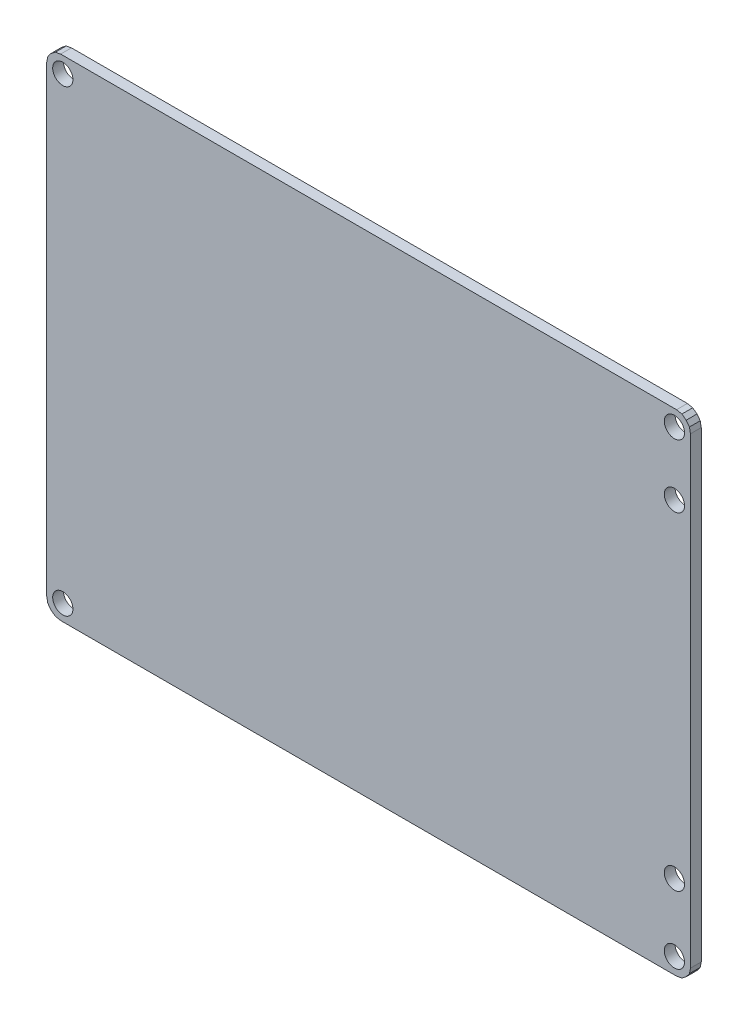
ISO-10303-21;
HEADER;
FILE_DESCRIPTION(('STEP AP214'),'2;1');
FILE_NAME('part.step','',(''),(''),'','','');
FILE_SCHEMA(('AUTOMOTIVE_DESIGN { 1 0 10303 214 1 1 1 1 }'));
ENDSEC;
DATA;
#1=APPLICATION_CONTEXT('core data for automotive mechanical design processes');
#2=APPLICATION_PROTOCOL_DEFINITION('international standard','automotive_design',2000,#1);
#3=PRODUCT_CONTEXT('',#1,'mechanical');
#4=PRODUCT('Part','Part','',(#3));
#5=PRODUCT_RELATED_PRODUCT_CATEGORY('part','',(#4));
#6=PRODUCT_DEFINITION_FORMATION('','',#4);
#7=PRODUCT_DEFINITION_CONTEXT('part definition',#1,'design');
#8=PRODUCT_DEFINITION('design','',#6,#7);
#9=PRODUCT_DEFINITION_SHAPE('','',#8);
#10=(LENGTH_UNIT() NAMED_UNIT(*) SI_UNIT(.MILLI.,.METRE.));
#11=(NAMED_UNIT(*) PLANE_ANGLE_UNIT() SI_UNIT($,.RADIAN.));
#12=(NAMED_UNIT(*) SI_UNIT($,.STERADIAN.) SOLID_ANGLE_UNIT());
#13=UNCERTAINTY_MEASURE_WITH_UNIT(LENGTH_MEASURE(1.E-05),#10,'distance_accuracy_value','');
#14=(GEOMETRIC_REPRESENTATION_CONTEXT(3) GLOBAL_UNCERTAINTY_ASSIGNED_CONTEXT((#13)) GLOBAL_UNIT_ASSIGNED_CONTEXT((#10,
#11,#12)) REPRESENTATION_CONTEXT('',''));
#15=CARTESIAN_POINT('',(0.,0.,0.));
#16=DIRECTION('',(0.,0.,1.));
#17=DIRECTION('',(1.,0.,0.));
#18=AXIS2_PLACEMENT_3D('',#15,#16,#17);
#19=CARTESIAN_POINT('',(0.,0.,1.6));
#20=DIRECTION('',(0.,0.,-1.));
#21=DIRECTION('',(-1.,0.,0.));
#22=AXIS2_PLACEMENT_3D('',#19,#20,#21);
#23=PLANE('',#22);
#24=DIRECTION('',(0.98058384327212,0.196100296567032,0.));
#25=VECTOR('',#24,1.);
#26=CARTESIAN_POINT('',(46.434366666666,-36.194999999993,1.6));
#27=LINE('',#26,#25);
#28=CARTESIAN_POINT('',(45.640633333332,-36.353733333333,1.6));
#29=VERTEX_POINT('',#28);
#30=CARTESIAN_POINT('',(46.434366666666,-36.194999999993,1.6));
#31=VERTEX_POINT('',#30);
#32=EDGE_CURVE('E276',#29,#31,#27,.T.);
#33=ORIENTED_EDGE('',*,*,#32,.T.);
#34=DIRECTION('',(0.799989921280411,0.600013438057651,0.));
#35=VECTOR('',#34,1.);
#36=CARTESIAN_POINT('',(47.069366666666,-35.718733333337,1.6));
#37=LINE('',#36,#35);
#38=CARTESIAN_POINT('',(47.069366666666,-35.718733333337,1.6));
#39=VERTEX_POINT('',#38);
#40=EDGE_CURVE('E140',#31,#39,#37,.T.);
#41=ORIENTED_EDGE('',*,*,#40,.T.);
#42=DIRECTION('',(0.600013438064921,0.799989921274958,0.));
#43=VECTOR('',#42,1.);
#44=CARTESIAN_POINT('',(47.545633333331,-35.083733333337,1.6));
#45=LINE('',#44,#43);
#46=CARTESIAN_POINT('',(47.545633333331,-35.083733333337,1.6));
#47=VERTEX_POINT('',#46);
#48=EDGE_CURVE('E345',#39,#47,#45,.T.);
#49=ORIENTED_EDGE('',*,*,#48,.T.);
#50=DIRECTION('',(0.196100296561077,0.980583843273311,0.));
#51=VECTOR('',#50,1.);
#52=CARTESIAN_POINT('',(47.704366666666,-34.290000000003,1.6));
#53=LINE('',#52,#51);
#54=CARTESIAN_POINT('',(47.704366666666,-34.290000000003,1.6));
#55=VERTEX_POINT('',#54);
#56=EDGE_CURVE('E365',#47,#55,#53,.T.);
#57=ORIENTED_EDGE('',*,*,#56,.T.);
#58=DIRECTION('',(0.,1.,0.));
#59=VECTOR('',#58,1.);
#60=CARTESIAN_POINT('',(47.704366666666,34.289999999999,1.6));
#61=LINE('',#60,#59);
#62=CARTESIAN_POINT('',(47.704366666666,34.289999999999,1.6));
#63=VERTEX_POINT('',#62);
#64=EDGE_CURVE('E361',#55,#63,#61,.T.);
#65=ORIENTED_EDGE('',*,*,#64,.T.);
#66=DIRECTION('',(-0.196100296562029,0.980583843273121,0.));
#67=VECTOR('',#66,1.);
#68=CARTESIAN_POINT('',(47.545633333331,35.083733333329,1.6));
#69=LINE('',#68,#67);
#70=CARTESIAN_POINT('',(47.545633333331,35.083733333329,1.6));
#71=VERTEX_POINT('',#70);
#72=EDGE_CURVE('E364',#63,#71,#69,.T.);
#73=ORIENTED_EDGE('',*,*,#72,.T.);
#74=DIRECTION('',(-0.600013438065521,0.799989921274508,0.));
#75=VECTOR('',#74,1.);
#76=CARTESIAN_POINT('',(47.069366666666,35.718733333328,1.6));
#77=LINE('',#76,#75);
#78=CARTESIAN_POINT('',(47.069366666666,35.718733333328,1.6));
#79=VERTEX_POINT('',#78);
#80=EDGE_CURVE('E369',#71,#79,#77,.T.);
#81=ORIENTED_EDGE('',*,*,#80,.T.);
#82=DIRECTION('',(-0.799989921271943,0.600013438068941,0.));
#83=VECTOR('',#82,1.);
#84=CARTESIAN_POINT('',(46.434366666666,36.194999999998,1.6));
#85=LINE('',#84,#83);
#86=CARTESIAN_POINT('',(46.434366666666,36.194999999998,1.6));
#87=VERTEX_POINT('',#86);
#88=EDGE_CURVE('E376',#79,#87,#85,.T.);
#89=ORIENTED_EDGE('',*,*,#88,.T.);
#90=DIRECTION('',(-0.980583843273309,0.196100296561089,0.));
#91=VECTOR('',#90,1.);
#92=CARTESIAN_POINT('',(45.640633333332,36.353733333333,1.6));
#93=LINE('',#92,#91);
#94=CARTESIAN_POINT('',(45.640633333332,36.353733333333,1.6));
#95=VERTEX_POINT('',#94);
#96=EDGE_CURVE('E379',#87,#95,#93,.T.);
#97=ORIENTED_EDGE('',*,*,#96,.T.);
#98=DIRECTION('',(-1.,0.,0.));
#99=VECTOR('',#98,1.);
#100=CARTESIAN_POINT('',(-45.640633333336,36.353733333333,1.6));
#101=LINE('',#100,#99);
#102=CARTESIAN_POINT('',(-45.640633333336,36.353733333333,1.6));
#103=VERTEX_POINT('',#102);
#104=EDGE_CURVE('E382',#95,#103,#101,.T.);
#105=ORIENTED_EDGE('',*,*,#104,.T.);
#106=DIRECTION('',(-0.98058384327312,-0.196100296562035,0.));
#107=VECTOR('',#106,1.);
#108=CARTESIAN_POINT('',(-46.434366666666,36.194999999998,1.6));
#109=LINE('',#108,#107);
#110=CARTESIAN_POINT('',(-46.434366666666,36.194999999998,1.6));
#111=VERTEX_POINT('',#110);
#112=EDGE_CURVE('E385',#103,#111,#109,.T.);
#113=ORIENTED_EDGE('',*,*,#112,.T.);
#114=DIRECTION('',(-0.799989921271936,-0.600013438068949,0.));
#115=VECTOR('',#114,1.);
#116=CARTESIAN_POINT('',(-47.069366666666,35.718733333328,1.6));
#117=LINE('',#116,#115);
#118=CARTESIAN_POINT('',(-47.069366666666,35.718733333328,1.6));
#119=VERTEX_POINT('',#118);
#120=EDGE_CURVE('E388',#111,#119,#117,.T.);
#121=ORIENTED_EDGE('',*,*,#120,.T.);
#122=DIRECTION('',(-0.600013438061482,-0.799989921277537,0.));
#123=VECTOR('',#122,1.);
#124=CARTESIAN_POINT('',(-47.545633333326,35.083733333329,1.6));
#125=LINE('',#124,#123);
#126=CARTESIAN_POINT('',(-47.545633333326,35.083733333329,1.6));
#127=VERTEX_POINT('',#126);
#128=EDGE_CURVE('E391',#119,#127,#125,.T.);
#129=ORIENTED_EDGE('',*,*,#128,.T.);
#130=DIRECTION('',(-0.19610029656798,-0.980583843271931,0.));
#131=VECTOR('',#130,1.);
#132=CARTESIAN_POINT('',(-47.704366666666,34.289999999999,1.6));
#133=LINE('',#132,#131);
#134=CARTESIAN_POINT('',(-47.704366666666,34.289999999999,1.6));
#135=VERTEX_POINT('',#134);
#136=EDGE_CURVE('E394',#127,#135,#133,.T.);
#137=ORIENTED_EDGE('',*,*,#136,.T.);
#138=DIRECTION('',(0.,-1.,0.));
#139=VECTOR('',#138,1.);
#140=CARTESIAN_POINT('',(-47.704366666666,-34.290000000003,1.6));
#141=LINE('',#140,#139);
#142=CARTESIAN_POINT('',(-47.704366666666,-34.290000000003,1.6));
#143=VERTEX_POINT('',#142);
#144=EDGE_CURVE('E397',#135,#143,#141,.T.);
#145=ORIENTED_EDGE('',*,*,#144,.T.);
#146=DIRECTION('',(0.196100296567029,-0.980583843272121,0.));
#147=VECTOR('',#146,1.);
#148=CARTESIAN_POINT('',(-47.545633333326,-35.083733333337,1.6));
#149=LINE('',#148,#147);
#150=CARTESIAN_POINT('',(-47.545633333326,-35.083733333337,1.6));
#151=VERTEX_POINT('',#150);
#152=EDGE_CURVE('E400',#143,#151,#149,.T.);
#153=ORIENTED_EDGE('',*,*,#152,.T.);
#154=DIRECTION('',(0.600013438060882,-0.799989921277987,0.));
#155=VECTOR('',#154,1.);
#156=CARTESIAN_POINT('',(-47.069366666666,-35.718733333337,1.6));
#157=LINE('',#156,#155);
#158=CARTESIAN_POINT('',(-47.069366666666,-35.718733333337,1.6));
#159=VERTEX_POINT('',#158);
#160=EDGE_CURVE('E195',#151,#159,#157,.T.);
#161=ORIENTED_EDGE('',*,*,#160,.T.);
#162=DIRECTION('',(0.799989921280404,-0.600013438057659,0.));
#163=VECTOR('',#162,1.);
#164=CARTESIAN_POINT('',(-46.434366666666,-36.194999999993,1.6));
#165=LINE('',#164,#163);
#166=CARTESIAN_POINT('',(-46.434366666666,-36.194999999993,1.6));
#167=VERTEX_POINT('',#166);
#168=EDGE_CURVE('E189',#159,#167,#165,.T.);
#169=ORIENTED_EDGE('',*,*,#168,.T.);
#170=DIRECTION('',(0.980583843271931,-0.196100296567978,0.));
#171=VECTOR('',#170,1.);
#172=CARTESIAN_POINT('',(-45.640633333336,-36.353733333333,1.6));
#173=LINE('',#172,#171);
#174=CARTESIAN_POINT('',(-45.640633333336,-36.353733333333,1.6));
#175=VERTEX_POINT('',#174);
#176=EDGE_CURVE('E193',#167,#175,#173,.T.);
#177=ORIENTED_EDGE('',*,*,#176,.T.);
#178=DIRECTION('',(1.,0.,0.));
#179=VECTOR('',#178,1.);
#180=CARTESIAN_POINT('',(45.640633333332,-36.353733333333,1.6));
#181=LINE('',#180,#179);
#182=EDGE_CURVE('E61',#175,#29,#181,.T.);
#183=ORIENTED_EDGE('',*,*,#182,.T.);
#184=EDGE_LOOP('',(#33,#41,#49,#57,#65,#73,#81,#89,#97,#105,#113,#121,#129,#137,#145,#153,#161,
#169,#177,#183));
#185=FACE_BOUND('',#184,.T.);
#186=CARTESIAN_POINT('',(-45.323133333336,-33.972500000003,1.6));
#187=DIRECTION('',(0.,0.,1.));
#188=DIRECTION('',(1.,0.,0.));
#189=AXIS2_PLACEMENT_3D('',#186,#187,#188);
#190=CIRCLE('',#189,1.5);
#191=CARTESIAN_POINT('',(-43.823133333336,-33.972500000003,1.6));
#192=VERTEX_POINT('',#191);
#193=EDGE_CURVE('E222',#192,#192,#190,.T.);
#194=ORIENTED_EDGE('',*,*,#193,.F.);
#195=EDGE_LOOP('',(#194));
#196=FACE_BOUND('',#195,.T.);
#197=CARTESIAN_POINT('',(-45.322866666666,33.972733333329,1.6));
#198=DIRECTION('',(0.,0.,1.));
#199=DIRECTION('',(1.,0.,0.));
#200=AXIS2_PLACEMENT_3D('',#197,#198,#199);
#201=CIRCLE('',#200,1.5);
#202=CARTESIAN_POINT('',(-43.822866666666,33.972733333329,1.6));
#203=VERTEX_POINT('',#202);
#204=EDGE_CURVE('E494',#203,#203,#201,.T.);
#205=ORIENTED_EDGE('',*,*,#204,.F.);
#206=EDGE_LOOP('',(#205));
#207=FACE_BOUND('',#206,.T.);
#208=CARTESIAN_POINT('',(45.323099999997,33.972499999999,1.6));
#209=DIRECTION('',(0.,0.,1.));
#210=DIRECTION('',(1.,0.,0.));
#211=AXIS2_PLACEMENT_3D('',#208,#209,#210);
#212=CIRCLE('',#211,1.5);
#213=CARTESIAN_POINT('',(46.823099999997,33.972499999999,1.6));
#214=VERTEX_POINT('',#213);
#215=EDGE_CURVE('E486',#214,#214,#212,.T.);
#216=ORIENTED_EDGE('',*,*,#215,.F.);
#217=EDGE_LOOP('',(#216));
#218=FACE_BOUND('',#217,.T.);
#219=CARTESIAN_POINT('',(45.323133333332,24.606266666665,1.6));
#220=DIRECTION('',(0.,0.,1.));
#221=DIRECTION('',(1.,0.,0.));
#222=AXIS2_PLACEMENT_3D('',#219,#220,#221);
#223=CIRCLE('',#222,1.5);
#224=CARTESIAN_POINT('',(46.823133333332,24.606266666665,1.6));
#225=VERTEX_POINT('',#224);
#226=EDGE_CURVE('E478',#225,#225,#223,.T.);
#227=ORIENTED_EDGE('',*,*,#226,.F.);
#228=EDGE_LOOP('',(#227));
#229=FACE_BOUND('',#228,.T.);
#230=CARTESIAN_POINT('',(45.323099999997,-33.972500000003,1.6));
#231=DIRECTION('',(0.,0.,1.));
#232=DIRECTION('',(1.,0.,0.));
#233=AXIS2_PLACEMENT_3D('',#230,#231,#232);
#234=CIRCLE('',#233,1.5);
#235=CARTESIAN_POINT('',(46.823099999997,-33.972500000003,1.6));
#236=VERTEX_POINT('',#235);
#237=EDGE_CURVE('E470',#236,#236,#234,.T.);
#238=ORIENTED_EDGE('',*,*,#237,.F.);
#239=EDGE_LOOP('',(#238));
#240=FACE_BOUND('',#239,.T.);
#241=CARTESIAN_POINT('',(45.323099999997,-23.971266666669,1.6));
#242=DIRECTION('',(0.,0.,1.));
#243=DIRECTION('',(1.,0.,0.));
#244=AXIS2_PLACEMENT_3D('',#241,#242,#243);
#245=CIRCLE('',#244,1.5);
#246=CARTESIAN_POINT('',(46.823099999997,-23.971266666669,1.6));
#247=VERTEX_POINT('',#246);
#248=EDGE_CURVE('E459',#247,#247,#245,.T.);
#249=ORIENTED_EDGE('',*,*,#248,.F.);
#250=EDGE_LOOP('',(#249));
#251=FACE_BOUND('',#250,.T.);
#252=ADVANCED_FACE('F43',(#185,#196,#207,#218,#229,#240,#251),#23,.F.);
#253=CARTESIAN_POINT('',(0.,0.,0.));
#254=DIRECTION('',(0.,0.,-1.));
#255=DIRECTION('',(-1.,0.,0.));
#256=AXIS2_PLACEMENT_3D('',#253,#254,#255);
#257=PLANE('',#256);
#258=CARTESIAN_POINT('',(45.323099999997,-33.972500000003,0.));
#259=DIRECTION('',(0.,0.,1.));
#260=DIRECTION('',(1.,0.,0.));
#261=AXIS2_PLACEMENT_3D('',#258,#259,#260);
#262=CIRCLE('',#261,1.5);
#263=CARTESIAN_POINT('',(46.823099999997,-33.972500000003,0.));
#264=VERTEX_POINT('',#263);
#265=EDGE_CURVE('E467',#264,#264,#262,.T.);
#266=ORIENTED_EDGE('',*,*,#265,.T.);
#267=EDGE_LOOP('',(#266));
#268=FACE_BOUND('',#267,.T.);
#269=CARTESIAN_POINT('',(45.323099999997,33.972499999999,0.));
#270=DIRECTION('',(0.,0.,1.));
#271=DIRECTION('',(1.,0.,0.));
#272=AXIS2_PLACEMENT_3D('',#269,#270,#271);
#273=CIRCLE('',#272,1.5);
#274=CARTESIAN_POINT('',(46.823099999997,33.972499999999,0.));
#275=VERTEX_POINT('',#274);
#276=EDGE_CURVE('E482',#275,#275,#273,.T.);
#277=ORIENTED_EDGE('',*,*,#276,.T.);
#278=EDGE_LOOP('',(#277));
#279=FACE_BOUND('',#278,.T.);
#280=CARTESIAN_POINT('',(-45.323133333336,-33.972500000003,0.));
#281=DIRECTION('',(0.,0.,1.));
#282=DIRECTION('',(1.,0.,0.));
#283=AXIS2_PLACEMENT_3D('',#280,#281,#282);
#284=CIRCLE('',#283,1.5);
#285=CARTESIAN_POINT('',(-43.823133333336,-33.972500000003,0.));
#286=VERTEX_POINT('',#285);
#287=EDGE_CURVE('E498',#286,#286,#284,.T.);
#288=ORIENTED_EDGE('',*,*,#287,.T.);
#289=EDGE_LOOP('',(#288));
#290=FACE_BOUND('',#289,.T.);
#291=DIRECTION('',(0.98058384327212,0.196100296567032,0.));
#292=VECTOR('',#291,1.);
#293=CARTESIAN_POINT('',(46.434366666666,-36.194999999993,0.));
#294=LINE('',#293,#292);
#295=CARTESIAN_POINT('',(45.640633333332,-36.353733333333,0.));
#296=VERTEX_POINT('',#295);
#297=CARTESIAN_POINT('',(46.434366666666,-36.194999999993,0.));
#298=VERTEX_POINT('',#297);
#299=EDGE_CURVE('E217',#296,#298,#294,.T.);
#300=ORIENTED_EDGE('',*,*,#299,.F.);
#301=DIRECTION('',(1.,0.,0.));
#302=VECTOR('',#301,1.);
#303=CARTESIAN_POINT('',(45.640633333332,-36.353733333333,0.));
#304=LINE('',#303,#302);
#305=CARTESIAN_POINT('',(-45.640633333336,-36.353733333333,0.));
#306=VERTEX_POINT('',#305);
#307=EDGE_CURVE('E132',#306,#296,#304,.T.);
#308=ORIENTED_EDGE('',*,*,#307,.F.);
#309=DIRECTION('',(0.980583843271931,-0.196100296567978,0.));
#310=VECTOR('',#309,1.);
#311=CARTESIAN_POINT('',(-45.640633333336,-36.353733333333,0.));
#312=LINE('',#311,#310);
#313=CARTESIAN_POINT('',(-46.434366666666,-36.194999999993,0.));
#314=VERTEX_POINT('',#313);
#315=EDGE_CURVE('E126',#314,#306,#312,.T.);
#316=ORIENTED_EDGE('',*,*,#315,.F.);
#317=DIRECTION('',(0.799989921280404,-0.600013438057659,0.));
#318=VECTOR('',#317,1.);
#319=CARTESIAN_POINT('',(-46.434366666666,-36.194999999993,0.));
#320=LINE('',#319,#318);
#321=CARTESIAN_POINT('',(-47.069366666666,-35.718733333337,0.));
#322=VERTEX_POINT('',#321);
#323=EDGE_CURVE('E204',#322,#314,#320,.T.);
#324=ORIENTED_EDGE('',*,*,#323,.F.);
#325=DIRECTION('',(0.600013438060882,-0.799989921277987,0.));
#326=VECTOR('',#325,1.);
#327=CARTESIAN_POINT('',(-47.069366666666,-35.718733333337,0.));
#328=LINE('',#327,#326);
#329=CARTESIAN_POINT('',(-47.545633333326,-35.083733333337,0.));
#330=VERTEX_POINT('',#329);
#331=EDGE_CURVE('E267',#330,#322,#328,.T.);
#332=ORIENTED_EDGE('',*,*,#331,.F.);
#333=DIRECTION('',(0.196100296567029,-0.980583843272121,0.));
#334=VECTOR('',#333,1.);
#335=CARTESIAN_POINT('',(-47.545633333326,-35.083733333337,0.));
#336=LINE('',#335,#334);
#337=CARTESIAN_POINT('',(-47.704366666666,-34.290000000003,0.));
#338=VERTEX_POINT('',#337);
#339=EDGE_CURVE('E264',#338,#330,#336,.T.);
#340=ORIENTED_EDGE('',*,*,#339,.F.);
#341=DIRECTION('',(0.,-1.,0.));
#342=VECTOR('',#341,1.);
#343=CARTESIAN_POINT('',(-47.704366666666,-34.290000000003,0.));
#344=LINE('',#343,#342);
#345=CARTESIAN_POINT('',(-47.704366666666,34.289999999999,0.));
#346=VERTEX_POINT('',#345);
#347=EDGE_CURVE('E261',#346,#338,#344,.T.);
#348=ORIENTED_EDGE('',*,*,#347,.F.);
#349=DIRECTION('',(-0.19610029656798,-0.980583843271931,0.));
#350=VECTOR('',#349,1.);
#351=CARTESIAN_POINT('',(-47.704366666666,34.289999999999,0.));
#352=LINE('',#351,#350);
#353=CARTESIAN_POINT('',(-47.545633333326,35.083733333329,0.));
#354=VERTEX_POINT('',#353);
#355=EDGE_CURVE('E258',#354,#346,#352,.T.);
#356=ORIENTED_EDGE('',*,*,#355,.F.);
#357=DIRECTION('',(-0.600013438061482,-0.799989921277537,0.));
#358=VECTOR('',#357,1.);
#359=CARTESIAN_POINT('',(-47.545633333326,35.083733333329,0.));
#360=LINE('',#359,#358);
#361=CARTESIAN_POINT('',(-47.069366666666,35.718733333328,0.));
#362=VERTEX_POINT('',#361);
#363=EDGE_CURVE('E255',#362,#354,#360,.T.);
#364=ORIENTED_EDGE('',*,*,#363,.F.);
#365=DIRECTION('',(-0.799989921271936,-0.600013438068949,0.));
#366=VECTOR('',#365,1.);
#367=CARTESIAN_POINT('',(-47.069366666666,35.718733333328,0.));
#368=LINE('',#367,#366);
#369=CARTESIAN_POINT('',(-46.434366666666,36.194999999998,0.));
#370=VERTEX_POINT('',#369);
#371=EDGE_CURVE('E252',#370,#362,#368,.T.);
#372=ORIENTED_EDGE('',*,*,#371,.F.);
#373=DIRECTION('',(-0.98058384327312,-0.196100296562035,0.));
#374=VECTOR('',#373,1.);
#375=CARTESIAN_POINT('',(-46.434366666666,36.194999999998,0.));
#376=LINE('',#375,#374);
#377=CARTESIAN_POINT('',(-45.640633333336,36.353733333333,0.));
#378=VERTEX_POINT('',#377);
#379=EDGE_CURVE('E249',#378,#370,#376,.T.);
#380=ORIENTED_EDGE('',*,*,#379,.F.);
#381=DIRECTION('',(-1.,0.,0.));
#382=VECTOR('',#381,1.);
#383=CARTESIAN_POINT('',(-45.640633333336,36.353733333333,0.));
#384=LINE('',#383,#382);
#385=CARTESIAN_POINT('',(45.640633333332,36.353733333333,0.));
#386=VERTEX_POINT('',#385);
#387=EDGE_CURVE('E246',#386,#378,#384,.T.);
#388=ORIENTED_EDGE('',*,*,#387,.F.);
#389=DIRECTION('',(-0.980583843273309,0.196100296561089,0.));
#390=VECTOR('',#389,1.);
#391=CARTESIAN_POINT('',(45.640633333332,36.353733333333,0.));
#392=LINE('',#391,#390);
#393=CARTESIAN_POINT('',(46.434366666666,36.194999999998,0.));
#394=VERTEX_POINT('',#393);
#395=EDGE_CURVE('E243',#394,#386,#392,.T.);
#396=ORIENTED_EDGE('',*,*,#395,.F.);
#397=DIRECTION('',(-0.799989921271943,0.600013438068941,0.));
#398=VECTOR('',#397,1.);
#399=CARTESIAN_POINT('',(46.434366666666,36.194999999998,0.));
#400=LINE('',#399,#398);
#401=CARTESIAN_POINT('',(47.069366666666,35.718733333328,0.));
#402=VERTEX_POINT('',#401);
#403=EDGE_CURVE('E240',#402,#394,#400,.T.);
#404=ORIENTED_EDGE('',*,*,#403,.F.);
#405=DIRECTION('',(-0.600013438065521,0.799989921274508,0.));
#406=VECTOR('',#405,1.);
#407=CARTESIAN_POINT('',(47.069366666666,35.718733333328,0.));
#408=LINE('',#407,#406);
#409=CARTESIAN_POINT('',(47.545633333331,35.083733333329,0.));
#410=VERTEX_POINT('',#409);
#411=EDGE_CURVE('E237',#410,#402,#408,.T.);
#412=ORIENTED_EDGE('',*,*,#411,.F.);
#413=DIRECTION('',(-0.196100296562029,0.980583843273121,0.));
#414=VECTOR('',#413,1.);
#415=CARTESIAN_POINT('',(47.545633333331,35.083733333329,0.));
#416=LINE('',#415,#414);
#417=CARTESIAN_POINT('',(47.704366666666,34.289999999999,0.));
#418=VERTEX_POINT('',#417);
#419=EDGE_CURVE('E234',#418,#410,#416,.T.);
#420=ORIENTED_EDGE('',*,*,#419,.F.);
#421=DIRECTION('',(0.,1.,0.));
#422=VECTOR('',#421,1.);
#423=CARTESIAN_POINT('',(47.704366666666,34.289999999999,0.));
#424=LINE('',#423,#422);
#425=CARTESIAN_POINT('',(47.704366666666,-34.290000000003,0.));
#426=VERTEX_POINT('',#425);
#427=EDGE_CURVE('E231',#426,#418,#424,.T.);
#428=ORIENTED_EDGE('',*,*,#427,.F.);
#429=DIRECTION('',(0.196100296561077,0.980583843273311,0.));
#430=VECTOR('',#429,1.);
#431=CARTESIAN_POINT('',(47.704366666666,-34.290000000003,0.));
#432=LINE('',#431,#430);
#433=CARTESIAN_POINT('',(47.545633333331,-35.083733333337,0.));
#434=VERTEX_POINT('',#433);
#435=EDGE_CURVE('E228',#434,#426,#432,.T.);
#436=ORIENTED_EDGE('',*,*,#435,.F.);
#437=DIRECTION('',(0.600013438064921,0.799989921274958,0.));
#438=VECTOR('',#437,1.);
#439=CARTESIAN_POINT('',(47.545633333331,-35.083733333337,0.));
#440=LINE('',#439,#438);
#441=CARTESIAN_POINT('',(47.069366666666,-35.718733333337,0.));
#442=VERTEX_POINT('',#441);
#443=EDGE_CURVE('E225',#442,#434,#440,.T.);
#444=ORIENTED_EDGE('',*,*,#443,.F.);
#445=DIRECTION('',(0.799989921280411,0.600013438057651,0.));
#446=VECTOR('',#445,1.);
#447=CARTESIAN_POINT('',(47.069366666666,-35.718733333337,0.));
#448=LINE('',#447,#446);
#449=EDGE_CURVE('E221',#298,#442,#448,.T.);
#450=ORIENTED_EDGE('',*,*,#449,.F.);
#451=EDGE_LOOP('',(#300,#308,#316,#324,#332,#340,#348,#356,#364,#372,#380,#388,#396,#404,#412,
#420,#428,#436,#444,#450));
#452=FACE_BOUND('',#451,.T.);
#453=CARTESIAN_POINT('',(-45.322866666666,33.972733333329,0.));
#454=DIRECTION('',(0.,0.,1.));
#455=DIRECTION('',(1.,0.,0.));
#456=AXIS2_PLACEMENT_3D('',#453,#454,#455);
#457=CIRCLE('',#456,1.5);
#458=CARTESIAN_POINT('',(-43.822866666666,33.972733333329,0.));
#459=VERTEX_POINT('',#458);
#460=EDGE_CURVE('E490',#459,#459,#457,.T.);
#461=ORIENTED_EDGE('',*,*,#460,.T.);
#462=EDGE_LOOP('',(#461));
#463=FACE_BOUND('',#462,.T.);
#464=CARTESIAN_POINT('',(45.323133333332,24.606266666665,0.));
#465=DIRECTION('',(0.,0.,1.));
#466=DIRECTION('',(1.,0.,0.));
#467=AXIS2_PLACEMENT_3D('',#464,#465,#466);
#468=CIRCLE('',#467,1.5);
#469=CARTESIAN_POINT('',(46.823133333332,24.606266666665,0.));
#470=VERTEX_POINT('',#469);
#471=EDGE_CURVE('E474',#470,#470,#468,.T.);
#472=ORIENTED_EDGE('',*,*,#471,.T.);
#473=EDGE_LOOP('',(#472));
#474=FACE_BOUND('',#473,.T.);
#475=CARTESIAN_POINT('',(45.323099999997,-23.971266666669,0.));
#476=DIRECTION('',(0.,0.,1.));
#477=DIRECTION('',(1.,0.,0.));
#478=AXIS2_PLACEMENT_3D('',#475,#476,#477);
#479=CIRCLE('',#478,1.5);
#480=CARTESIAN_POINT('',(46.823099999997,-23.971266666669,0.));
#481=VERTEX_POINT('',#480);
#482=EDGE_CURVE('E462',#481,#481,#479,.T.);
#483=ORIENTED_EDGE('',*,*,#482,.T.);
#484=EDGE_LOOP('',(#483));
#485=FACE_BOUND('',#484,.T.);
#486=ADVANCED_FACE('F349',(#268,#279,#290,#452,#463,#474,#485),#257,.T.);
#487=CARTESIAN_POINT('',(46.434366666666,-36.194999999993,1.6));
#488=DIRECTION('',(-0.196100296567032,0.98058384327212,0.));
#489=DIRECTION('',(-0.98058384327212,-0.196100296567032,0.));
#490=AXIS2_PLACEMENT_3D('',#487,#488,#489);
#491=PLANE('',#490);
#492=ORIENTED_EDGE('',*,*,#299,.T.);
#493=DIRECTION('',(0.,0.,-1.));
#494=VECTOR('',#493,1.);
#495=CARTESIAN_POINT('',(46.434366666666,-36.194999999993,1.6));
#496=LINE('',#495,#494);
#497=EDGE_CURVE('E11',#31,#298,#496,.T.);
#498=ORIENTED_EDGE('',*,*,#497,.F.);
#499=ORIENTED_EDGE('',*,*,#32,.F.);
#500=DIRECTION('',(0.,0.,-1.));
#501=VECTOR('',#500,1.);
#502=CARTESIAN_POINT('',(45.640633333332,-36.353733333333,1.6));
#503=LINE('',#502,#501);
#504=EDGE_CURVE('E213',#29,#296,#503,.T.);
#505=ORIENTED_EDGE('',*,*,#504,.T.);
#506=EDGE_LOOP('',(#492,#498,#499,#505));
#507=FACE_BOUND('',#506,.T.);
#508=ADVANCED_FACE('F45',(#507),#491,.F.);
#509=CARTESIAN_POINT('',(47.069366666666,-35.718733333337,1.6));
#510=DIRECTION('',(-0.600013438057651,0.79998992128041,0.));
#511=DIRECTION('',(-0.79998992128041,-0.600013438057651,0.));
#512=AXIS2_PLACEMENT_3D('',#509,#510,#511);
#513=PLANE('',#512);
#514=ORIENTED_EDGE('',*,*,#449,.T.);
#515=DIRECTION('',(0.,0.,-1.));
#516=VECTOR('',#515,1.);
#517=CARTESIAN_POINT('',(47.069366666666,-35.718733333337,1.6));
#518=LINE('',#517,#516);
#519=EDGE_CURVE('E53',#39,#442,#518,.T.);
#520=ORIENTED_EDGE('',*,*,#519,.F.);
#521=ORIENTED_EDGE('',*,*,#40,.F.);
#522=ORIENTED_EDGE('',*,*,#497,.T.);
#523=EDGE_LOOP('',(#514,#520,#521,#522));
#524=FACE_BOUND('',#523,.T.);
#525=ADVANCED_FACE('F732',(#524),#513,.F.);
#526=CARTESIAN_POINT('',(47.545633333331,-35.083733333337,1.6));
#527=DIRECTION('',(-0.799989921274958,0.600013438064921,0.));
#528=DIRECTION('',(-0.600013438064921,-0.799989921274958,0.));
#529=AXIS2_PLACEMENT_3D('',#526,#527,#528);
#530=PLANE('',#529);
#531=ORIENTED_EDGE('',*,*,#443,.T.);
#532=DIRECTION('',(0.,0.,-1.));
#533=VECTOR('',#532,1.);
#534=CARTESIAN_POINT('',(47.545633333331,-35.083733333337,1.6));
#535=LINE('',#534,#533);
#536=EDGE_CURVE('E335',#47,#434,#535,.T.);
#537=ORIENTED_EDGE('',*,*,#536,.F.);
#538=ORIENTED_EDGE('',*,*,#48,.F.);
#539=ORIENTED_EDGE('',*,*,#519,.T.);
#540=EDGE_LOOP('',(#531,#537,#538,#539));
#541=FACE_BOUND('',#540,.T.);
#542=ADVANCED_FACE('F343',(#541),#530,.F.);
#543=CARTESIAN_POINT('',(47.704366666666,-34.290000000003,1.6));
#544=DIRECTION('',(-0.980583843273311,0.196100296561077,0.));
#545=DIRECTION('',(-0.196100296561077,-0.980583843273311,0.));
#546=AXIS2_PLACEMENT_3D('',#543,#544,#545);
#547=PLANE('',#546);
#548=ORIENTED_EDGE('',*,*,#435,.T.);
#549=DIRECTION('',(0.,0.,-1.));
#550=VECTOR('',#549,1.);
#551=CARTESIAN_POINT('',(47.704366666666,-34.290000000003,1.6));
#552=LINE('',#551,#550);
#553=EDGE_CURVE('E331',#55,#426,#552,.T.);
#554=ORIENTED_EDGE('',*,*,#553,.F.);
#555=ORIENTED_EDGE('',*,*,#56,.F.);
#556=ORIENTED_EDGE('',*,*,#536,.T.);
#557=EDGE_LOOP('',(#548,#554,#555,#556));
#558=FACE_BOUND('',#557,.T.);
#559=ADVANCED_FACE('F355',(#558),#547,.F.);
#560=CARTESIAN_POINT('',(47.704366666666,34.289999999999,1.6));
#561=DIRECTION('',(-1.,0.,0.));
#562=DIRECTION('',(0.,0.,1.));
#563=AXIS2_PLACEMENT_3D('',#560,#561,#562);
#564=PLANE('',#563);
#565=ORIENTED_EDGE('',*,*,#427,.T.);
#566=DIRECTION('',(0.,0.,-1.));
#567=VECTOR('',#566,1.);
#568=CARTESIAN_POINT('',(47.704366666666,34.289999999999,1.6));
#569=LINE('',#568,#567);
#570=EDGE_CURVE('E327',#63,#418,#569,.T.);
#571=ORIENTED_EDGE('',*,*,#570,.F.);
#572=ORIENTED_EDGE('',*,*,#64,.F.);
#573=ORIENTED_EDGE('',*,*,#553,.T.);
#574=EDGE_LOOP('',(#565,#571,#572,#573));
#575=FACE_BOUND('',#574,.T.);
#576=ADVANCED_FACE('F359',(#575),#564,.F.);
#577=CARTESIAN_POINT('',(47.545633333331,35.083733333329,1.6));
#578=DIRECTION('',(-0.980583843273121,-0.196100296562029,0.));
#579=DIRECTION('',(0.196100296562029,-0.980583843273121,0.));
#580=AXIS2_PLACEMENT_3D('',#577,#578,#579);
#581=PLANE('',#580);
#582=ORIENTED_EDGE('',*,*,#419,.T.);
#583=DIRECTION('',(0.,0.,-1.));
#584=VECTOR('',#583,1.);
#585=CARTESIAN_POINT('',(47.545633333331,35.083733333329,1.6));
#586=LINE('',#585,#584);
#587=EDGE_CURVE('E323',#71,#410,#586,.T.);
#588=ORIENTED_EDGE('',*,*,#587,.F.);
#589=ORIENTED_EDGE('',*,*,#72,.F.);
#590=ORIENTED_EDGE('',*,*,#570,.T.);
#591=EDGE_LOOP('',(#582,#588,#589,#590));
#592=FACE_BOUND('',#591,.T.);
#593=ADVANCED_FACE('F693',(#592),#581,.F.);
#594=CARTESIAN_POINT('',(47.069366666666,35.718733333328,1.6));
#595=DIRECTION('',(-0.799989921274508,-0.600013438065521,0.));
#596=DIRECTION('',(0.600013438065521,-0.799989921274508,0.));
#597=AXIS2_PLACEMENT_3D('',#594,#595,#596);
#598=PLANE('',#597);
#599=ORIENTED_EDGE('',*,*,#411,.T.);
#600=DIRECTION('',(0.,0.,-1.));
#601=VECTOR('',#600,1.);
#602=CARTESIAN_POINT('',(47.069366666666,35.718733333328,1.6));
#603=LINE('',#602,#601);
#604=EDGE_CURVE('E319',#79,#402,#603,.T.);
#605=ORIENTED_EDGE('',*,*,#604,.F.);
#606=ORIENTED_EDGE('',*,*,#80,.F.);
#607=ORIENTED_EDGE('',*,*,#587,.T.);
#608=EDGE_LOOP('',(#599,#605,#606,#607));
#609=FACE_BOUND('',#608,.T.);
#610=ADVANCED_FACE('F682',(#609),#598,.F.);
#611=CARTESIAN_POINT('',(46.434366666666,36.194999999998,1.6));
#612=DIRECTION('',(-0.600013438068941,-0.799989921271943,0.));
#613=DIRECTION('',(0.799989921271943,-0.600013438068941,0.));
#614=AXIS2_PLACEMENT_3D('',#611,#612,#613);
#615=PLANE('',#614);
#616=ORIENTED_EDGE('',*,*,#403,.T.);
#617=DIRECTION('',(0.,0.,-1.));
#618=VECTOR('',#617,1.);
#619=CARTESIAN_POINT('',(46.434366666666,36.194999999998,1.6));
#620=LINE('',#619,#618);
#621=EDGE_CURVE('E315',#87,#394,#620,.T.);
#622=ORIENTED_EDGE('',*,*,#621,.F.);
#623=ORIENTED_EDGE('',*,*,#88,.F.);
#624=ORIENTED_EDGE('',*,*,#604,.T.);
#625=EDGE_LOOP('',(#616,#622,#623,#624));
#626=FACE_BOUND('',#625,.T.);
#627=ADVANCED_FACE('F671',(#626),#615,.F.);
#628=CARTESIAN_POINT('',(45.640633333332,36.353733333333,1.6));
#629=DIRECTION('',(-0.196100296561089,-0.980583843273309,0.));
#630=DIRECTION('',(0.980583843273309,-0.196100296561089,0.));
#631=AXIS2_PLACEMENT_3D('',#628,#629,#630);
#632=PLANE('',#631);
#633=ORIENTED_EDGE('',*,*,#395,.T.);
#634=DIRECTION('',(0.,0.,-1.));
#635=VECTOR('',#634,1.);
#636=CARTESIAN_POINT('',(45.640633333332,36.353733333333,1.6));
#637=LINE('',#636,#635);
#638=EDGE_CURVE('E311',#95,#386,#637,.T.);
#639=ORIENTED_EDGE('',*,*,#638,.F.);
#640=ORIENTED_EDGE('',*,*,#96,.F.);
#641=ORIENTED_EDGE('',*,*,#621,.T.);
#642=EDGE_LOOP('',(#633,#639,#640,#641));
#643=FACE_BOUND('',#642,.T.);
#644=ADVANCED_FACE('F660',(#643),#632,.F.);
#645=CARTESIAN_POINT('',(-45.640633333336,36.353733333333,1.6));
#646=DIRECTION('',(0.,-1.,0.));
#647=DIRECTION('',(0.,0.,-1.));
#648=AXIS2_PLACEMENT_3D('',#645,#646,#647);
#649=PLANE('',#648);
#650=ORIENTED_EDGE('',*,*,#387,.T.);
#651=DIRECTION('',(0.,0.,-1.));
#652=VECTOR('',#651,1.);
#653=CARTESIAN_POINT('',(-45.640633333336,36.353733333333,1.6));
#654=LINE('',#653,#652);
#655=EDGE_CURVE('E307',#103,#378,#654,.T.);
#656=ORIENTED_EDGE('',*,*,#655,.F.);
#657=ORIENTED_EDGE('',*,*,#104,.F.);
#658=ORIENTED_EDGE('',*,*,#638,.T.);
#659=EDGE_LOOP('',(#650,#656,#657,#658));
#660=FACE_BOUND('',#659,.T.);
#661=ADVANCED_FACE('F649',(#660),#649,.F.);
#662=CARTESIAN_POINT('',(-46.434366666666,36.194999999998,1.6));
#663=DIRECTION('',(0.196100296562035,-0.98058384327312,0.));
#664=DIRECTION('',(0.98058384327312,0.196100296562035,0.));
#665=AXIS2_PLACEMENT_3D('',#662,#663,#664);
#666=PLANE('',#665);
#667=ORIENTED_EDGE('',*,*,#379,.T.);
#668=DIRECTION('',(0.,0.,-1.));
#669=VECTOR('',#668,1.);
#670=CARTESIAN_POINT('',(-46.434366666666,36.194999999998,1.6));
#671=LINE('',#670,#669);
#672=EDGE_CURVE('E303',#111,#370,#671,.T.);
#673=ORIENTED_EDGE('',*,*,#672,.F.);
#674=ORIENTED_EDGE('',*,*,#112,.F.);
#675=ORIENTED_EDGE('',*,*,#655,.T.);
#676=EDGE_LOOP('',(#667,#673,#674,#675));
#677=FACE_BOUND('',#676,.T.);
#678=ADVANCED_FACE('F638',(#677),#666,.F.);
#679=CARTESIAN_POINT('',(-47.069366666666,35.718733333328,1.6));
#680=DIRECTION('',(0.600013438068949,-0.799989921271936,0.));
#681=DIRECTION('',(0.799989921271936,0.600013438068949,0.));
#682=AXIS2_PLACEMENT_3D('',#679,#680,#681);
#683=PLANE('',#682);
#684=ORIENTED_EDGE('',*,*,#371,.T.);
#685=DIRECTION('',(0.,0.,-1.));
#686=VECTOR('',#685,1.);
#687=CARTESIAN_POINT('',(-47.069366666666,35.718733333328,1.6));
#688=LINE('',#687,#686);
#689=EDGE_CURVE('E299',#119,#362,#688,.T.);
#690=ORIENTED_EDGE('',*,*,#689,.F.);
#691=ORIENTED_EDGE('',*,*,#120,.F.);
#692=ORIENTED_EDGE('',*,*,#672,.T.);
#693=EDGE_LOOP('',(#684,#690,#691,#692));
#694=FACE_BOUND('',#693,.T.);
#695=ADVANCED_FACE('F627',(#694),#683,.F.);
#696=CARTESIAN_POINT('',(-47.545633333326,35.083733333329,1.6));
#697=DIRECTION('',(0.799989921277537,-0.600013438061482,0.));
#698=DIRECTION('',(0.600013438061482,0.799989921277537,0.));
#699=AXIS2_PLACEMENT_3D('',#696,#697,#698);
#700=PLANE('',#699);
#701=ORIENTED_EDGE('',*,*,#363,.T.);
#702=DIRECTION('',(0.,0.,-1.));
#703=VECTOR('',#702,1.);
#704=CARTESIAN_POINT('',(-47.545633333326,35.083733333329,1.6));
#705=LINE('',#704,#703);
#706=EDGE_CURVE('E295',#127,#354,#705,.T.);
#707=ORIENTED_EDGE('',*,*,#706,.F.);
#708=ORIENTED_EDGE('',*,*,#128,.F.);
#709=ORIENTED_EDGE('',*,*,#689,.T.);
#710=EDGE_LOOP('',(#701,#707,#708,#709));
#711=FACE_BOUND('',#710,.T.);
#712=ADVANCED_FACE('F616',(#711),#700,.F.);
#713=CARTESIAN_POINT('',(-47.704366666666,34.289999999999,1.6));
#714=DIRECTION('',(0.980583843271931,-0.19610029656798,0.));
#715=DIRECTION('',(0.19610029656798,0.980583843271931,0.));
#716=AXIS2_PLACEMENT_3D('',#713,#714,#715);
#717=PLANE('',#716);
#718=ORIENTED_EDGE('',*,*,#355,.T.);
#719=DIRECTION('',(0.,0.,-1.));
#720=VECTOR('',#719,1.);
#721=CARTESIAN_POINT('',(-47.704366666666,34.289999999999,1.6));
#722=LINE('',#721,#720);
#723=EDGE_CURVE('E291',#135,#346,#722,.T.);
#724=ORIENTED_EDGE('',*,*,#723,.F.);
#725=ORIENTED_EDGE('',*,*,#136,.F.);
#726=ORIENTED_EDGE('',*,*,#706,.T.);
#727=EDGE_LOOP('',(#718,#724,#725,#726));
#728=FACE_BOUND('',#727,.T.);
#729=ADVANCED_FACE('F605',(#728),#717,.F.);
#730=CARTESIAN_POINT('',(-47.704366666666,-34.290000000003,1.6));
#731=DIRECTION('',(1.,0.,0.));
#732=DIRECTION('',(0.,0.,-1.));
#733=AXIS2_PLACEMENT_3D('',#730,#731,#732);
#734=PLANE('',#733);
#735=ORIENTED_EDGE('',*,*,#347,.T.);
#736=DIRECTION('',(0.,0.,-1.));
#737=VECTOR('',#736,1.);
#738=CARTESIAN_POINT('',(-47.704366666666,-34.290000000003,1.6));
#739=LINE('',#738,#737);
#740=EDGE_CURVE('E287',#143,#338,#739,.T.);
#741=ORIENTED_EDGE('',*,*,#740,.F.);
#742=ORIENTED_EDGE('',*,*,#144,.F.);
#743=ORIENTED_EDGE('',*,*,#723,.T.);
#744=EDGE_LOOP('',(#735,#741,#742,#743));
#745=FACE_BOUND('',#744,.T.);
#746=ADVANCED_FACE('F595',(#745),#734,.F.);
#747=CARTESIAN_POINT('',(-47.545633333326,-35.083733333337,1.6));
#748=DIRECTION('',(0.980583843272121,0.196100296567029,0.));
#749=DIRECTION('',(-0.196100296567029,0.980583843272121,0.));
#750=AXIS2_PLACEMENT_3D('',#747,#748,#749);
#751=PLANE('',#750);
#752=ORIENTED_EDGE('',*,*,#339,.T.);
#753=DIRECTION('',(0.,0.,-1.));
#754=VECTOR('',#753,1.);
#755=CARTESIAN_POINT('',(-47.545633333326,-35.083733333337,1.6));
#756=LINE('',#755,#754);
#757=EDGE_CURVE('E283',#151,#330,#756,.T.);
#758=ORIENTED_EDGE('',*,*,#757,.F.);
#759=ORIENTED_EDGE('',*,*,#152,.F.);
#760=ORIENTED_EDGE('',*,*,#740,.T.);
#761=EDGE_LOOP('',(#752,#758,#759,#760));
#762=FACE_BOUND('',#761,.T.);
#763=ADVANCED_FACE('F408',(#762),#751,.F.);
#764=CARTESIAN_POINT('',(-47.069366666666,-35.718733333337,1.6));
#765=DIRECTION('',(0.799989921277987,0.600013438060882,0.));
#766=DIRECTION('',(-0.600013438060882,0.799989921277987,0.));
#767=AXIS2_PLACEMENT_3D('',#764,#765,#766);
#768=PLANE('',#767);
#769=ORIENTED_EDGE('',*,*,#331,.T.);
#770=DIRECTION('',(0.,0.,-1.));
#771=VECTOR('',#770,1.);
#772=CARTESIAN_POINT('',(-47.069366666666,-35.718733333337,1.6));
#773=LINE('',#772,#771);
#774=EDGE_CURVE('E206',#159,#322,#773,.T.);
#775=ORIENTED_EDGE('',*,*,#774,.F.);
#776=ORIENTED_EDGE('',*,*,#160,.F.);
#777=ORIENTED_EDGE('',*,*,#757,.T.);
#778=EDGE_LOOP('',(#769,#775,#776,#777));
#779=FACE_BOUND('',#778,.T.);
#780=ADVANCED_FACE('F412',(#779),#768,.F.);
#781=CARTESIAN_POINT('',(-46.434366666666,-36.194999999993,1.6));
#782=DIRECTION('',(0.600013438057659,0.799989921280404,0.));
#783=DIRECTION('',(-0.799989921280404,0.600013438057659,0.));
#784=AXIS2_PLACEMENT_3D('',#781,#782,#783);
#785=PLANE('',#784);
#786=ORIENTED_EDGE('',*,*,#323,.T.);
#787=DIRECTION('',(0.,0.,-1.));
#788=VECTOR('',#787,1.);
#789=CARTESIAN_POINT('',(-46.434366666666,-36.194999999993,1.6));
#790=LINE('',#789,#788);
#791=EDGE_CURVE('E201',#167,#314,#790,.T.);
#792=ORIENTED_EDGE('',*,*,#791,.F.);
#793=ORIENTED_EDGE('',*,*,#168,.F.);
#794=ORIENTED_EDGE('',*,*,#774,.T.);
#795=EDGE_LOOP('',(#786,#792,#793,#794));
#796=FACE_BOUND('',#795,.T.);
#797=ADVANCED_FACE('F202',(#796),#785,.F.);
#798=CARTESIAN_POINT('',(-45.640633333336,-36.353733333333,1.6));
#799=DIRECTION('',(0.196100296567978,0.980583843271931,0.));
#800=DIRECTION('',(-0.980583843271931,0.196100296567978,0.));
#801=AXIS2_PLACEMENT_3D('',#798,#799,#800);
#802=PLANE('',#801);
#803=ORIENTED_EDGE('',*,*,#315,.T.);
#804=DIRECTION('',(0.,0.,-1.));
#805=VECTOR('',#804,1.);
#806=CARTESIAN_POINT('',(-45.640633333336,-36.353733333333,1.6));
#807=LINE('',#806,#805);
#808=EDGE_CURVE('E207',#175,#306,#807,.T.);
#809=ORIENTED_EDGE('',*,*,#808,.F.);
#810=ORIENTED_EDGE('',*,*,#176,.F.);
#811=ORIENTED_EDGE('',*,*,#791,.T.);
#812=EDGE_LOOP('',(#803,#809,#810,#811));
#813=FACE_BOUND('',#812,.T.);
#814=ADVANCED_FACE('F209',(#813),#802,.F.);
#815=CARTESIAN_POINT('',(45.640633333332,-36.353733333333,1.6));
#816=DIRECTION('',(0.,1.,0.));
#817=DIRECTION('',(0.,0.,1.));
#818=AXIS2_PLACEMENT_3D('',#815,#816,#817);
#819=PLANE('',#818);
#820=ORIENTED_EDGE('',*,*,#307,.T.);
#821=ORIENTED_EDGE('',*,*,#504,.F.);
#822=ORIENTED_EDGE('',*,*,#182,.F.);
#823=ORIENTED_EDGE('',*,*,#808,.T.);
#824=EDGE_LOOP('',(#820,#821,#822,#823));
#825=FACE_BOUND('',#824,.T.);
#826=ADVANCED_FACE('F416',(#825),#819,.F.);
#827=CARTESIAN_POINT('',(-45.323133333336,-33.972500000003,1.6));
#828=DIRECTION('',(0.,0.,-1.));
#829=DIRECTION('',(-1.,0.,0.));
#830=AXIS2_PLACEMENT_3D('',#827,#828,#829);
#831=CYLINDRICAL_SURFACE('',#830,1.5);
#832=ORIENTED_EDGE('',*,*,#193,.T.);
#833=EDGE_LOOP('',(#832));
#834=FACE_BOUND('',#833,.T.);
#835=ORIENTED_EDGE('',*,*,#287,.F.);
#836=EDGE_LOOP('',(#835));
#837=FACE_BOUND('',#836,.T.);
#838=ADVANCED_FACE('F418',(#834,#837),#831,.F.);
#839=CARTESIAN_POINT('',(-45.322866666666,33.972733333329,1.6));
#840=DIRECTION('',(0.,0.,-1.));
#841=DIRECTION('',(-1.,0.,0.));
#842=AXIS2_PLACEMENT_3D('',#839,#840,#841);
#843=CYLINDRICAL_SURFACE('',#842,1.5);
#844=ORIENTED_EDGE('',*,*,#204,.T.);
#845=EDGE_LOOP('',(#844));
#846=FACE_BOUND('',#845,.T.);
#847=ORIENTED_EDGE('',*,*,#460,.F.);
#848=EDGE_LOOP('',(#847));
#849=FACE_BOUND('',#848,.T.);
#850=ADVANCED_FACE('F424',(#846,#849),#843,.F.);
#851=CARTESIAN_POINT('',(45.323099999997,33.972499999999,1.6));
#852=DIRECTION('',(0.,0.,-1.));
#853=DIRECTION('',(-1.,0.,0.));
#854=AXIS2_PLACEMENT_3D('',#851,#852,#853);
#855=CYLINDRICAL_SURFACE('',#854,1.5);
#856=ORIENTED_EDGE('',*,*,#215,.T.);
#857=EDGE_LOOP('',(#856));
#858=FACE_BOUND('',#857,.T.);
#859=ORIENTED_EDGE('',*,*,#276,.F.);
#860=EDGE_LOOP('',(#859));
#861=FACE_BOUND('',#860,.T.);
#862=ADVANCED_FACE('F438',(#858,#861),#855,.F.);
#863=CARTESIAN_POINT('',(45.323133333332,24.606266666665,1.6));
#864=DIRECTION('',(0.,0.,-1.));
#865=DIRECTION('',(-1.,0.,0.));
#866=AXIS2_PLACEMENT_3D('',#863,#864,#865);
#867=CYLINDRICAL_SURFACE('',#866,1.5);
#868=ORIENTED_EDGE('',*,*,#226,.T.);
#869=EDGE_LOOP('',(#868));
#870=FACE_BOUND('',#869,.T.);
#871=ORIENTED_EDGE('',*,*,#471,.F.);
#872=EDGE_LOOP('',(#871));
#873=FACE_BOUND('',#872,.T.);
#874=ADVANCED_FACE('F442',(#870,#873),#867,.F.);
#875=CARTESIAN_POINT('',(45.323099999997,-33.972500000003,1.6));
#876=DIRECTION('',(0.,0.,-1.));
#877=DIRECTION('',(-1.,0.,0.));
#878=AXIS2_PLACEMENT_3D('',#875,#876,#877);
#879=CYLINDRICAL_SURFACE('',#878,1.5);
#880=ORIENTED_EDGE('',*,*,#237,.T.);
#881=EDGE_LOOP('',(#880));
#882=FACE_BOUND('',#881,.T.);
#883=ORIENTED_EDGE('',*,*,#265,.F.);
#884=EDGE_LOOP('',(#883));
#885=FACE_BOUND('',#884,.T.);
#886=ADVANCED_FACE('F446',(#882,#885),#879,.F.);
#887=CARTESIAN_POINT('',(45.323099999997,-23.971266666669,1.6));
#888=DIRECTION('',(0.,0.,-1.));
#889=DIRECTION('',(-1.,0.,0.));
#890=AXIS2_PLACEMENT_3D('',#887,#888,#889);
#891=CYLINDRICAL_SURFACE('',#890,1.5);
#892=ORIENTED_EDGE('',*,*,#248,.T.);
#893=EDGE_LOOP('',(#892));
#894=FACE_BOUND('',#893,.T.);
#895=ORIENTED_EDGE('',*,*,#482,.F.);
#896=EDGE_LOOP('',(#895));
#897=FACE_BOUND('',#896,.T.);
#898=ADVANCED_FACE('F450',(#894,#897),#891,.F.);
#899=CLOSED_SHELL('',(#252,#486,#508,#525,#542,#559,#576,#593,#610,#627,#644,#661,#678,#695,
#712,#729,#746,#763,#780,#797,#814,#826,#838,#850,#862,#874,#886,#898));
#900=MANIFOLD_SOLID_BREP('B2',#899);
#901=ADVANCED_BREP_SHAPE_REPRESENTATION('',(#18,#900),#14);
#902=SHAPE_DEFINITION_REPRESENTATION(#9,#901);
ENDSEC;
END-ISO-10303-21;
